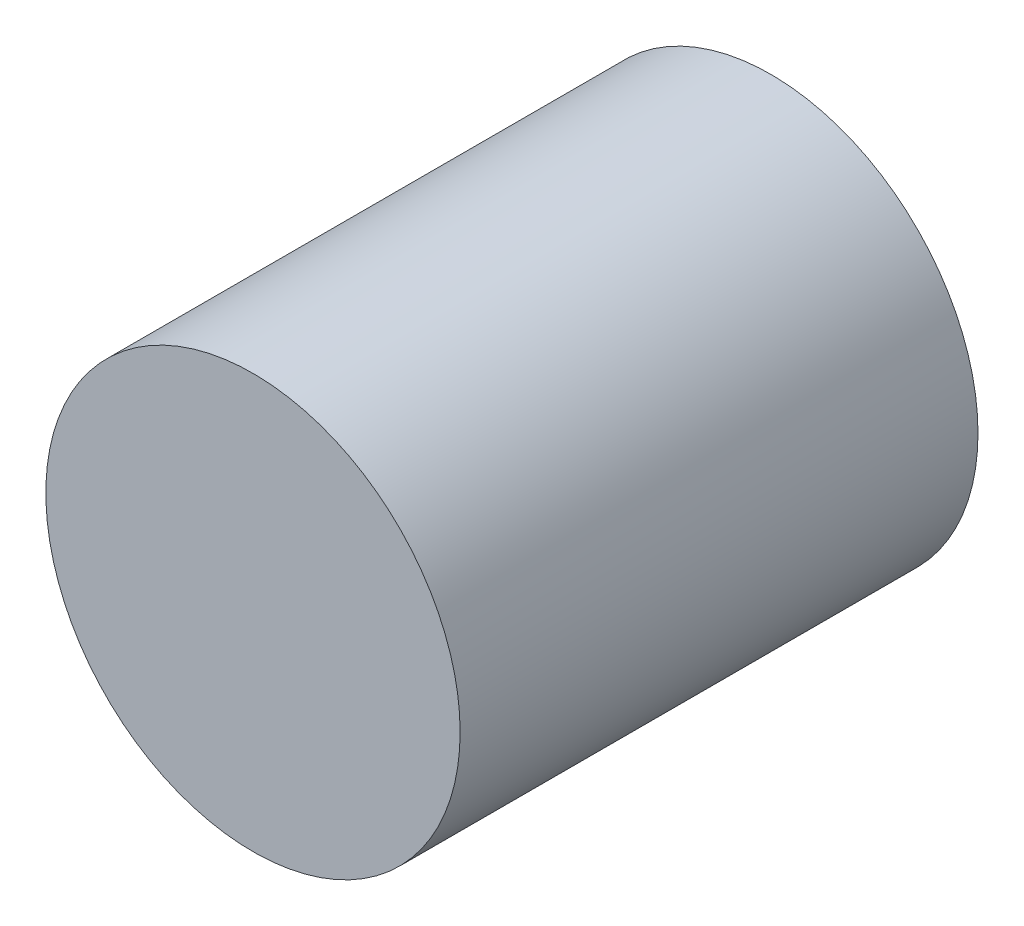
from build123d import *

# Parameters (mm, degrees)
SKIZZE1_R                       = 10
AUFSATZ_LINEAR_AUSTRAGEN1_DEPTH = 25


with BuildPart() as part:
    # Skizze1 → Aufsatz-Linear austragen1 (new body)
    with BuildSketch(Plane.XY):
        Circle(SKIZZE1_R)
    extrude(amount=AUFSATZ_LINEAR_AUSTRAGEN1_DEPTH)


solid = part.part
